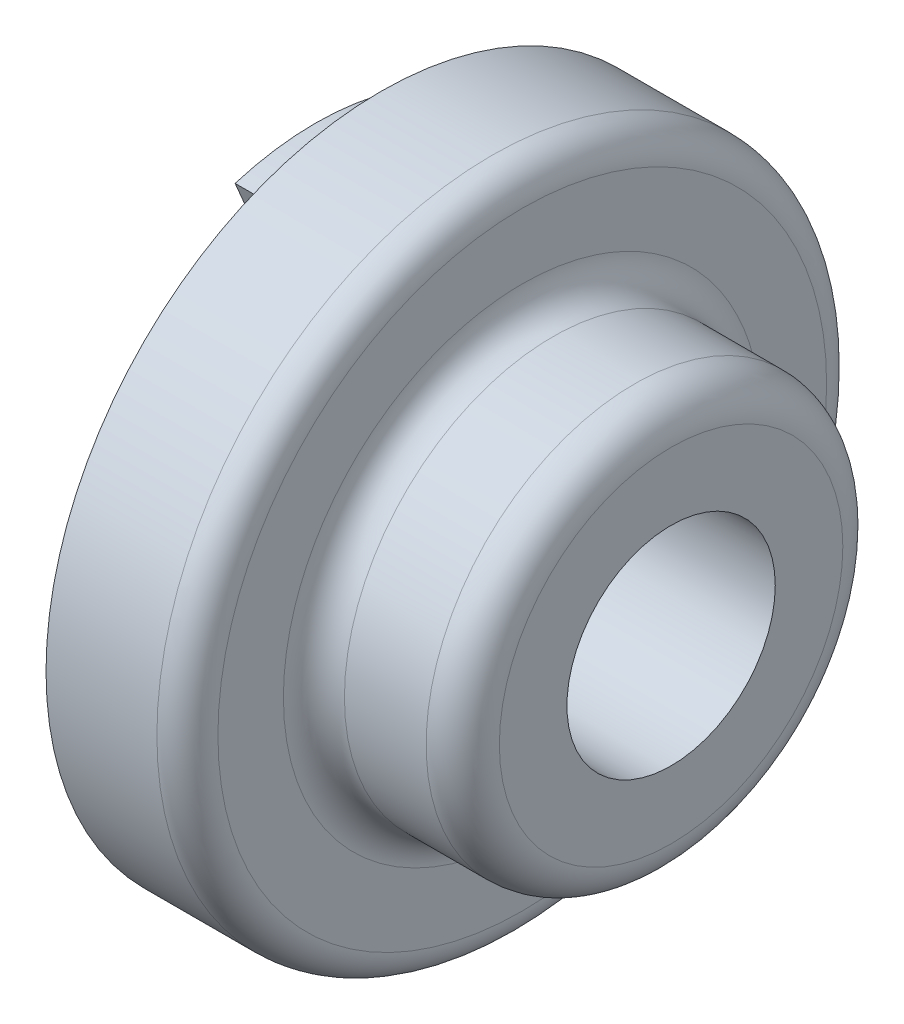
ISO-10303-21;
HEADER;
FILE_DESCRIPTION(('STEP AP214'),'2;1');
FILE_NAME('part.step','',(''),(''),'','','');
FILE_SCHEMA(('AUTOMOTIVE_DESIGN { 1 0 10303 214 1 1 1 1 }'));
ENDSEC;
DATA;
#1=APPLICATION_CONTEXT('core data for automotive mechanical design processes');
#2=APPLICATION_PROTOCOL_DEFINITION('international standard','automotive_design',2000,#1);
#3=PRODUCT_CONTEXT('',#1,'mechanical');
#4=PRODUCT('Part','Part','',(#3));
#5=PRODUCT_RELATED_PRODUCT_CATEGORY('part','',(#4));
#6=PRODUCT_DEFINITION_FORMATION('','',#4);
#7=PRODUCT_DEFINITION_CONTEXT('part definition',#1,'design');
#8=PRODUCT_DEFINITION('design','',#6,#7);
#9=PRODUCT_DEFINITION_SHAPE('','',#8);
#10=(LENGTH_UNIT() NAMED_UNIT(*) SI_UNIT(.MILLI.,.METRE.));
#11=(NAMED_UNIT(*) PLANE_ANGLE_UNIT() SI_UNIT($,.RADIAN.));
#12=(NAMED_UNIT(*) SI_UNIT($,.STERADIAN.) SOLID_ANGLE_UNIT());
#13=UNCERTAINTY_MEASURE_WITH_UNIT(LENGTH_MEASURE(1.E-05),#10,'distance_accuracy_value','');
#14=(GEOMETRIC_REPRESENTATION_CONTEXT(3) GLOBAL_UNCERTAINTY_ASSIGNED_CONTEXT((#13)) GLOBAL_UNIT_ASSIGNED_CONTEXT((#10,
#11,#12)) REPRESENTATION_CONTEXT('',''));
#15=CARTESIAN_POINT('',(0.,0.,0.));
#16=DIRECTION('',(0.,0.,1.));
#17=DIRECTION('',(1.,0.,0.));
#18=AXIS2_PLACEMENT_3D('',#15,#16,#17);
#19=CARTESIAN_POINT('',(20.5,5.77,0.));
#20=DIRECTION('',(1.,0.,0.));
#21=DIRECTION('',(0.,0.,-1.));
#22=AXIS2_PLACEMENT_3D('',#19,#20,#21);
#23=PLANE('',#22);
#24=CARTESIAN_POINT('',(20.5,0.,0.));
#25=DIRECTION('',(1.,0.,0.));
#26=DIRECTION('',(0.,0.,-1.));
#27=AXIS2_PLACEMENT_3D('',#24,#25,#26);
#28=CIRCLE('',#27,7.);
#29=CARTESIAN_POINT('',(20.5,0.,-7.));
#30=VERTEX_POINT('',#29);
#31=EDGE_CURVE('E224',#30,#30,#28,.F.);
#32=ORIENTED_EDGE('',*,*,#31,.T.);
#33=EDGE_LOOP('',(#32));
#34=FACE_BOUND('',#33,.T.);
#35=CARTESIAN_POINT('',(20.5,0.,0.));
#36=DIRECTION('',(-1.,0.,0.));
#37=DIRECTION('',(0.,0.,-1.));
#38=AXIS2_PLACEMENT_3D('',#35,#36,#37);
#39=CIRCLE('',#38,11.54);
#40=CARTESIAN_POINT('',(20.5,0.,-11.54));
#41=VERTEX_POINT('',#40);
#42=CARTESIAN_POINT('',(20.5,0.,11.54));
#43=VERTEX_POINT('',#42);
#44=EDGE_CURVE('E589',#41,#43,#39,.T.);
#45=ORIENTED_EDGE('',*,*,#44,.F.);
#46=CARTESIAN_POINT('',(20.5,0.,0.));
#47=DIRECTION('',(-1.,0.,0.));
#48=DIRECTION('',(0.,1.,0.));
#49=AXIS2_PLACEMENT_3D('',#46,#47,#48);
#50=CIRCLE('',#49,11.54);
#51=CARTESIAN_POINT('',(20.5,11.54,0.));
#52=VERTEX_POINT('',#51);
#53=EDGE_CURVE('E187',#52,#41,#50,.T.);
#54=ORIENTED_EDGE('',*,*,#53,.F.);
#55=CARTESIAN_POINT('',(20.5,0.,0.));
#56=DIRECTION('',(-1.,0.,0.));
#57=DIRECTION('',(0.,0.,1.));
#58=AXIS2_PLACEMENT_3D('',#55,#56,#57);
#59=CIRCLE('',#58,11.54);
#60=EDGE_CURVE('E591',#43,#52,#59,.T.);
#61=ORIENTED_EDGE('',*,*,#60,.F.);
#62=EDGE_LOOP('',(#45,#54,#61));
#63=FACE_BOUND('',#62,.T.);
#64=ADVANCED_FACE('F16',(#34,#63),#23,.T.);
#65=CARTESIAN_POINT('',(18.04,0.,0.));
#66=DIRECTION('',(1.,0.,0.));
#67=DIRECTION('',(0.,0.,-1.));
#68=AXIS2_PLACEMENT_3D('',#65,#66,#67);
#69=TOROIDAL_SURFACE('',#68,11.54,2.46);
#70=CARTESIAN_POINT('',(18.04,0.,0.));
#71=DIRECTION('',(1.,0.,0.));
#72=DIRECTION('',(0.,0.,-1.));
#73=AXIS2_PLACEMENT_3D('',#70,#71,#72);
#74=CIRCLE('',#73,14.);
#75=CARTESIAN_POINT('',(18.04,0.,-14.));
#76=VERTEX_POINT('',#75);
#77=EDGE_CURVE('E227',#76,#76,#74,.F.);
#78=ORIENTED_EDGE('',*,*,#77,.F.);
#79=EDGE_LOOP('',(#78));
#80=FACE_BOUND('',#79,.T.);
#81=ORIENTED_EDGE('',*,*,#60,.T.);
#82=ORIENTED_EDGE('',*,*,#53,.T.);
#83=ORIENTED_EDGE('',*,*,#44,.T.);
#84=EDGE_LOOP('',(#81,#82,#83));
#85=FACE_BOUND('',#84,.T.);
#86=ADVANCED_FACE('F392',(#80,#85),#69,.T.);
#87=CARTESIAN_POINT('',(0.,0.,0.));
#88=DIRECTION('',(-1.,0.,0.));
#89=DIRECTION('',(0.,0.,1.));
#90=AXIS2_PLACEMENT_3D('',#87,#88,#89);
#91=PLANE('',#90);
#92=CARTESIAN_POINT('',(0.,0.,0.));
#93=DIRECTION('',(1.,0.,0.));
#94=DIRECTION('',(0.,0.,-1.));
#95=AXIS2_PLACEMENT_3D('',#92,#93,#94);
#96=CIRCLE('',#95,7.);
#97=CARTESIAN_POINT('',(0.,6.94652777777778,-0.86356924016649));
#98=VERTEX_POINT('',#97);
#99=CARTESIAN_POINT('',(0.,6.94652777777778,0.863569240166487));
#100=VERTEX_POINT('',#99);
#101=EDGE_CURVE('E186',#98,#100,#96,.T.);
#102=ORIENTED_EDGE('',*,*,#101,.T.);
#103=CARTESIAN_POINT('',(0.,7.2,0.));
#104=DIRECTION('',(1.,0.,0.));
#105=DIRECTION('',(0.,0.,-1.));
#106=AXIS2_PLACEMENT_3D('',#103,#104,#105);
#107=CIRCLE('',#106,0.9);
#108=EDGE_CURVE('E220',#98,#100,#107,.F.);
#109=ORIENTED_EDGE('',*,*,#108,.F.);
#110=EDGE_LOOP('',(#102,#109));
#111=FACE_BOUND('',#110,.T.);
#112=ADVANCED_FACE('F403',(#111),#91,.F.);
#113=CARTESIAN_POINT('',(0.,0.,0.));
#114=DIRECTION('',(-1.,0.,0.));
#115=DIRECTION('',(0.,0.,1.));
#116=AXIS2_PLACEMENT_3D('',#113,#114,#115);
#117=PLANE('',#116);
#118=CARTESIAN_POINT('',(0.,0.,0.));
#119=DIRECTION('',(1.,0.,0.));
#120=DIRECTION('',(0.,0.,-1.));
#121=AXIS2_PLACEMENT_3D('',#118,#119,#120);
#122=CIRCLE('',#121,7.);
#123=CARTESIAN_POINT('',(0.,-6.94652777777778,0.863569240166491));
#124=VERTEX_POINT('',#123);
#125=CARTESIAN_POINT('',(0.,-6.94652777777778,-0.863569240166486));
#126=VERTEX_POINT('',#125);
#127=EDGE_CURVE('E179',#124,#126,#122,.T.);
#128=ORIENTED_EDGE('',*,*,#127,.T.);
#129=CARTESIAN_POINT('',(0.,-7.2,0.));
#130=DIRECTION('',(1.,0.,0.));
#131=DIRECTION('',(0.,0.,-1.));
#132=AXIS2_PLACEMENT_3D('',#129,#130,#131);
#133=CIRCLE('',#132,0.9);
#134=EDGE_CURVE('E184',#124,#126,#133,.F.);
#135=ORIENTED_EDGE('',*,*,#134,.F.);
#136=EDGE_LOOP('',(#128,#135));
#137=FACE_BOUND('',#136,.T.);
#138=ADVANCED_FACE('F182',(#137),#117,.F.);
#139=CARTESIAN_POINT('',(12.3,0.,0.));
#140=DIRECTION('',(1.,0.,0.));
#141=DIRECTION('',(0.,0.,-1.));
#142=AXIS2_PLACEMENT_3D('',#139,#140,#141);
#143=CYLINDRICAL_SURFACE('',#142,7.);
#144=ORIENTED_EDGE('',*,*,#31,.F.);
#145=EDGE_LOOP('',(#144));
#146=FACE_BOUND('',#145,.T.);
#147=CARTESIAN_POINT('',(6.5,0.,0.));
#148=DIRECTION('',(1.,0.,0.));
#149=DIRECTION('',(0.,0.,-1.));
#150=AXIS2_PLACEMENT_3D('',#147,#148,#149);
#151=CIRCLE('',#150,7.);
#152=CARTESIAN_POINT('',(6.5,6.94652777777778,0.863569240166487));
#153=VERTEX_POINT('',#152);
#154=CARTESIAN_POINT('',(6.5,-6.94652777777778,0.86356924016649));
#155=VERTEX_POINT('',#154);
#156=EDGE_CURVE('E217',#153,#155,#151,.T.);
#157=ORIENTED_EDGE('',*,*,#156,.F.);
#158=DIRECTION('',(1.,0.,0.));
#159=VECTOR('',#158,1.);
#160=CARTESIAN_POINT('',(-3.4,6.94652777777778,0.863569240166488));
#161=LINE('',#160,#159);
#162=EDGE_CURVE('E375',#100,#153,#161,.T.);
#163=ORIENTED_EDGE('',*,*,#162,.F.);
#164=ORIENTED_EDGE('',*,*,#101,.F.);
#165=DIRECTION('',(1.,0.,0.));
#166=VECTOR('',#165,1.);
#167=CARTESIAN_POINT('',(-3.4,6.94652777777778,-0.863569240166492));
#168=LINE('',#167,#166);
#169=CARTESIAN_POINT('',(6.5,6.94652777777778,-0.863569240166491));
#170=VERTEX_POINT('',#169);
#171=EDGE_CURVE('E223',#170,#98,#168,.F.);
#172=ORIENTED_EDGE('',*,*,#171,.F.);
#173=CARTESIAN_POINT('',(6.5,0.,0.));
#174=DIRECTION('',(1.,0.,0.));
#175=DIRECTION('',(0.,0.,-1.));
#176=AXIS2_PLACEMENT_3D('',#173,#174,#175);
#177=CIRCLE('',#176,7.);
#178=CARTESIAN_POINT('',(6.5,-6.94652777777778,-0.863569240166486));
#179=VERTEX_POINT('',#178);
#180=EDGE_CURVE('E193',#179,#170,#177,.T.);
#181=ORIENTED_EDGE('',*,*,#180,.F.);
#182=DIRECTION('',(1.,0.,0.));
#183=VECTOR('',#182,1.);
#184=CARTESIAN_POINT('',(-3.4,-6.94652777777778,-0.863569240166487));
#185=LINE('',#184,#183);
#186=EDGE_CURVE('E190',#126,#179,#185,.T.);
#187=ORIENTED_EDGE('',*,*,#186,.F.);
#188=ORIENTED_EDGE('',*,*,#127,.F.);
#189=DIRECTION('',(1.,0.,0.));
#190=VECTOR('',#189,1.);
#191=CARTESIAN_POINT('',(-3.4,-6.94652777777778,0.863569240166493));
#192=LINE('',#191,#190);
#193=EDGE_CURVE('E201',#155,#124,#192,.F.);
#194=ORIENTED_EDGE('',*,*,#193,.F.);
#195=EDGE_LOOP('',(#157,#163,#164,#172,#181,#187,#188,#194));
#196=FACE_BOUND('',#195,.T.);
#197=ADVANCED_FACE('F191',(#146,#196),#143,.F.);
#198=CARTESIAN_POINT('',(15.295,0.,0.));
#199=DIRECTION('',(1.,0.,0.));
#200=DIRECTION('',(0.,0.,-1.));
#201=AXIS2_PLACEMENT_3D('',#198,#199,#200);
#202=CYLINDRICAL_SURFACE('',#201,14.);
#203=CARTESIAN_POINT('',(12.55,0.,0.));
#204=DIRECTION('',(-1.,0.,0.));
#205=DIRECTION('',(0.,0.,1.));
#206=AXIS2_PLACEMENT_3D('',#203,#204,#205);
#207=CIRCLE('',#206,14.);
#208=CARTESIAN_POINT('',(12.55,0.,14.));
#209=VERTEX_POINT('',#208);
#210=EDGE_CURVE('E353',#209,#209,#207,.T.);
#211=ORIENTED_EDGE('',*,*,#210,.F.);
#212=EDGE_LOOP('',(#211));
#213=FACE_BOUND('',#212,.T.);
#214=ORIENTED_EDGE('',*,*,#77,.T.);
#215=EDGE_LOOP('',(#214));
#216=FACE_BOUND('',#215,.T.);
#217=ADVANCED_FACE('F622',(#213,#216),#202,.T.);
#218=CARTESIAN_POINT('',(-3.4,7.2,0.));
#219=DIRECTION('',(1.,0.,0.));
#220=DIRECTION('',(0.,0.,-1.));
#221=AXIS2_PLACEMENT_3D('',#218,#219,#220);
#222=CYLINDRICAL_SURFACE('',#221,0.9);
#223=ORIENTED_EDGE('',*,*,#171,.T.);
#224=ORIENTED_EDGE('',*,*,#108,.T.);
#225=ORIENTED_EDGE('',*,*,#162,.T.);
#226=CARTESIAN_POINT('',(6.5,7.2,0.));
#227=DIRECTION('',(1.,0.,0.));
#228=DIRECTION('',(0.,0.,-1.));
#229=AXIS2_PLACEMENT_3D('',#226,#227,#228);
#230=CIRCLE('',#229,0.9);
#231=CARTESIAN_POINT('',(6.5,7.04371664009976,0.886326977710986));
#232=VERTEX_POINT('',#231);
#233=EDGE_CURVE('E203',#232,#153,#230,.T.);
#234=ORIENTED_EDGE('',*,*,#233,.F.);
#235=DIRECTION('',(1.,0.,0.));
#236=VECTOR('',#235,1.);
#237=CARTESIAN_POINT('',(-3.4,7.04371664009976,0.886326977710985));
#238=LINE('',#237,#236);
#239=CARTESIAN_POINT('',(-3.4,7.04371664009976,0.886326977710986));
#240=VERTEX_POINT('',#239);
#241=EDGE_CURVE('E347',#240,#232,#238,.T.);
#242=ORIENTED_EDGE('',*,*,#241,.F.);
#243=CARTESIAN_POINT('',(-3.4,7.2,0.));
#244=DIRECTION('',(1.,0.,0.));
#245=DIRECTION('',(0.,0.,-1.));
#246=AXIS2_PLACEMENT_3D('',#243,#244,#245);
#247=CIRCLE('',#246,0.9);
#248=CARTESIAN_POINT('',(-3.4,7.04371664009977,-0.886326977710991));
#249=VERTEX_POINT('',#248);
#250=EDGE_CURVE('E370',#240,#249,#247,.T.);
#251=ORIENTED_EDGE('',*,*,#250,.T.);
#252=DIRECTION('',(1.,0.,0.));
#253=VECTOR('',#252,1.);
#254=CARTESIAN_POINT('',(-3.4,7.04371664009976,-0.886326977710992));
#255=LINE('',#254,#253);
#256=CARTESIAN_POINT('',(6.5,7.04371664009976,-0.886326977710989));
#257=VERTEX_POINT('',#256);
#258=EDGE_CURVE('E352',#257,#249,#255,.F.);
#259=ORIENTED_EDGE('',*,*,#258,.F.);
#260=CARTESIAN_POINT('',(6.5,7.2,0.));
#261=DIRECTION('',(1.,0.,0.));
#262=DIRECTION('',(0.,0.,-1.));
#263=AXIS2_PLACEMENT_3D('',#260,#261,#262);
#264=CIRCLE('',#263,0.9);
#265=EDGE_CURVE('E671',#170,#257,#264,.T.);
#266=ORIENTED_EDGE('',*,*,#265,.F.);
#267=EDGE_LOOP('',(#223,#224,#225,#234,#242,#251,#259,#266));
#268=FACE_BOUND('',#267,.T.);
#269=ADVANCED_FACE('F626',(#268),#222,.T.);
#270=CARTESIAN_POINT('',(6.5,9.305,0.));
#271=DIRECTION('',(-1.,0.,0.));
#272=DIRECTION('',(0.,0.,1.));
#273=AXIS2_PLACEMENT_3D('',#270,#271,#272);
#274=PLANE('',#273);
#275=DIRECTION('',(0.,-0.920240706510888,-0.391352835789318));
#276=VECTOR('',#275,1.);
#277=CARTESIAN_POINT('',(6.5,7.04371664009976,0.886326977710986));
#278=LINE('',#277,#276);
#279=CARTESIAN_POINT('',(6.5,17.643822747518,5.39425795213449));
#280=VERTEX_POINT('',#279);
#281=EDGE_CURVE('E348',#232,#280,#278,.F.);
#282=ORIENTED_EDGE('',*,*,#281,.F.);
#283=ORIENTED_EDGE('',*,*,#233,.T.);
#284=ORIENTED_EDGE('',*,*,#156,.T.);
#285=CARTESIAN_POINT('',(6.5,-7.2,0.));
#286=DIRECTION('',(1.,0.,0.));
#287=DIRECTION('',(0.,0.,-1.));
#288=AXIS2_PLACEMENT_3D('',#285,#286,#287);
#289=CIRCLE('',#288,0.9);
#290=CARTESIAN_POINT('',(6.5,-7.04371664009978,0.886326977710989));
#291=VERTEX_POINT('',#290);
#292=EDGE_CURVE('E196',#291,#155,#289,.F.);
#293=ORIENTED_EDGE('',*,*,#292,.F.);
#294=DIRECTION('',(0.,-0.920240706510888,0.391352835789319));
#295=VECTOR('',#294,1.);
#296=CARTESIAN_POINT('',(6.5,-17.643822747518,5.39425795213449));
#297=LINE('',#296,#295);
#298=CARTESIAN_POINT('',(6.5,-17.643822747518,5.3942579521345));
#299=VERTEX_POINT('',#298);
#300=EDGE_CURVE('E329',#299,#291,#297,.F.);
#301=ORIENTED_EDGE('',*,*,#300,.F.);
#302=CARTESIAN_POINT('',(6.5,0.,0.));
#303=DIRECTION('',(-1.,0.,0.));
#304=DIRECTION('',(0.,0.,1.));
#305=AXIS2_PLACEMENT_3D('',#302,#303,#304);
#306=CIRCLE('',#305,18.45);
#307=CARTESIAN_POINT('',(6.5,-17.7009894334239,5.20360193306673));
#308=VERTEX_POINT('',#307);
#309=EDGE_CURVE('E213',#299,#308,#306,.F.);
#310=ORIENTED_EDGE('',*,*,#309,.T.);
#311=DIRECTION('',(0.,-0.926837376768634,0.375463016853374));
#312=VECTOR('',#311,1.);
#313=CARTESIAN_POINT('',(6.5,-17.7009894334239,5.20360193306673));
#314=LINE('',#313,#312);
#315=CARTESIAN_POINT('',(6.5,-17.8500064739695,5.26396892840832));
#316=VERTEX_POINT('',#315);
#317=EDGE_CURVE('E216',#308,#316,#314,.T.);
#318=ORIENTED_EDGE('',*,*,#317,.T.);
#319=CARTESIAN_POINT('',(6.5,0.,0.));
#320=DIRECTION('',(1.,0.,0.));
#321=DIRECTION('',(0.,0.,-1.));
#322=AXIS2_PLACEMENT_3D('',#319,#320,#321);
#323=CIRCLE('',#322,18.61);
#324=CARTESIAN_POINT('',(6.5,17.8500064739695,5.26396892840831));
#325=VERTEX_POINT('',#324);
#326=EDGE_CURVE('E333',#325,#316,#323,.T.);
#327=ORIENTED_EDGE('',*,*,#326,.F.);
#328=DIRECTION('',(0.,-0.926837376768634,-0.375463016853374));
#329=VECTOR('',#328,1.);
#330=CARTESIAN_POINT('',(6.5,17.8500064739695,5.26396892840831));
#331=LINE('',#330,#329);
#332=CARTESIAN_POINT('',(6.5,17.7009894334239,5.20360193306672));
#333=VERTEX_POINT('',#332);
#334=EDGE_CURVE('E212',#325,#333,#331,.T.);
#335=ORIENTED_EDGE('',*,*,#334,.T.);
#336=CARTESIAN_POINT('',(6.5,0.,0.));
#337=DIRECTION('',(-1.,0.,0.));
#338=DIRECTION('',(0.,0.,1.));
#339=AXIS2_PLACEMENT_3D('',#336,#337,#338);
#340=CIRCLE('',#339,18.45);
#341=EDGE_CURVE('E210',#333,#280,#340,.F.);
#342=ORIENTED_EDGE('',*,*,#341,.T.);
#343=EDGE_LOOP('',(#282,#283,#284,#293,#301,#310,#318,#327,#335,#342));
#344=FACE_BOUND('',#343,.T.);
#345=ADVANCED_FACE('F633',(#344),#274,.T.);
#346=CARTESIAN_POINT('',(-3.4,-7.2,0.));
#347=DIRECTION('',(1.,0.,0.));
#348=DIRECTION('',(0.,0.,-1.));
#349=AXIS2_PLACEMENT_3D('',#346,#347,#348);
#350=CYLINDRICAL_SURFACE('',#349,0.9);
#351=DIRECTION('',(1.,0.,0.));
#352=VECTOR('',#351,1.);
#353=CARTESIAN_POINT('',(-3.4,-7.04371664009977,0.886326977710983));
#354=LINE('',#353,#352);
#355=CARTESIAN_POINT('',(-3.4,-7.04371664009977,0.886326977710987));
#356=VERTEX_POINT('',#355);
#357=EDGE_CURVE('E332',#291,#356,#354,.F.);
#358=ORIENTED_EDGE('',*,*,#357,.F.);
#359=ORIENTED_EDGE('',*,*,#292,.T.);
#360=ORIENTED_EDGE('',*,*,#193,.T.);
#361=ORIENTED_EDGE('',*,*,#134,.T.);
#362=ORIENTED_EDGE('',*,*,#186,.T.);
#363=CARTESIAN_POINT('',(6.5,-7.2,0.));
#364=DIRECTION('',(1.,0.,0.));
#365=DIRECTION('',(0.,0.,-1.));
#366=AXIS2_PLACEMENT_3D('',#363,#364,#365);
#367=CIRCLE('',#366,0.9);
#368=CARTESIAN_POINT('',(6.5,-7.04371664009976,-0.886326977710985));
#369=VERTEX_POINT('',#368);
#370=EDGE_CURVE('E372',#369,#179,#367,.T.);
#371=ORIENTED_EDGE('',*,*,#370,.F.);
#372=DIRECTION('',(1.,0.,0.));
#373=VECTOR('',#372,1.);
#374=CARTESIAN_POINT('',(-3.4,-7.04371664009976,-0.886326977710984));
#375=LINE('',#374,#373);
#376=CARTESIAN_POINT('',(-3.4,-7.04371664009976,-0.886326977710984));
#377=VERTEX_POINT('',#376);
#378=EDGE_CURVE('E327',#377,#369,#375,.T.);
#379=ORIENTED_EDGE('',*,*,#378,.F.);
#380=CARTESIAN_POINT('',(-3.4,-7.2,0.));
#381=DIRECTION('',(1.,0.,0.));
#382=DIRECTION('',(0.,0.,-1.));
#383=AXIS2_PLACEMENT_3D('',#380,#381,#382);
#384=CIRCLE('',#383,0.9);
#385=EDGE_CURVE('E362',#377,#356,#384,.T.);
#386=ORIENTED_EDGE('',*,*,#385,.T.);
#387=EDGE_LOOP('',(#358,#359,#360,#361,#362,#371,#379,#386));
#388=FACE_BOUND('',#387,.T.);
#389=ADVANCED_FACE('F199',(#388),#350,.T.);
#390=CARTESIAN_POINT('',(6.5,9.305,0.));
#391=DIRECTION('',(-1.,0.,0.));
#392=DIRECTION('',(0.,0.,1.));
#393=AXIS2_PLACEMENT_3D('',#390,#391,#392);
#394=PLANE('',#393);
#395=DIRECTION('',(0.,0.920240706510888,0.391352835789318));
#396=VECTOR('',#395,1.);
#397=CARTESIAN_POINT('',(6.5,-7.04371664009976,-0.886326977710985));
#398=LINE('',#397,#396);
#399=CARTESIAN_POINT('',(6.5,-17.643822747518,-5.39425795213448));
#400=VERTEX_POINT('',#399);
#401=EDGE_CURVE('E328',#369,#400,#398,.F.);
#402=ORIENTED_EDGE('',*,*,#401,.F.);
#403=ORIENTED_EDGE('',*,*,#370,.T.);
#404=ORIENTED_EDGE('',*,*,#180,.T.);
#405=ORIENTED_EDGE('',*,*,#265,.T.);
#406=DIRECTION('',(0.,0.920240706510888,-0.391352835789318));
#407=VECTOR('',#406,1.);
#408=CARTESIAN_POINT('',(6.5,17.643822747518,-5.39425795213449));
#409=LINE('',#408,#407);
#410=CARTESIAN_POINT('',(6.5,17.643822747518,-5.39425795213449));
#411=VERTEX_POINT('',#410);
#412=EDGE_CURVE('E349',#411,#257,#409,.F.);
#413=ORIENTED_EDGE('',*,*,#412,.F.);
#414=CARTESIAN_POINT('',(6.5,0.,0.));
#415=DIRECTION('',(-1.,0.,0.));
#416=DIRECTION('',(0.,0.,1.));
#417=AXIS2_PLACEMENT_3D('',#414,#415,#416);
#418=CIRCLE('',#417,18.45);
#419=CARTESIAN_POINT('',(6.5,17.7009894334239,-5.20360193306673));
#420=VERTEX_POINT('',#419);
#421=EDGE_CURVE('E425',#411,#420,#418,.F.);
#422=ORIENTED_EDGE('',*,*,#421,.T.);
#423=DIRECTION('',(0.,0.926837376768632,-0.375463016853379));
#424=VECTOR('',#423,1.);
#425=CARTESIAN_POINT('',(6.5,17.7009894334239,-5.20360193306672));
#426=LINE('',#425,#424);
#427=CARTESIAN_POINT('',(6.5,17.8500064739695,-5.26396892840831));
#428=VERTEX_POINT('',#427);
#429=EDGE_CURVE('E422',#420,#428,#426,.T.);
#430=ORIENTED_EDGE('',*,*,#429,.T.);
#431=CARTESIAN_POINT('',(6.5,0.,0.));
#432=DIRECTION('',(1.,0.,0.));
#433=DIRECTION('',(0.,0.,-1.));
#434=AXIS2_PLACEMENT_3D('',#431,#432,#433);
#435=CIRCLE('',#434,18.61);
#436=CARTESIAN_POINT('',(6.5,-17.8500064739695,-5.26396892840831));
#437=VERTEX_POINT('',#436);
#438=EDGE_CURVE('E356',#437,#428,#435,.T.);
#439=ORIENTED_EDGE('',*,*,#438,.F.);
#440=DIRECTION('',(0.,0.926837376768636,0.37546301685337));
#441=VECTOR('',#440,1.);
#442=CARTESIAN_POINT('',(6.5,-17.8500064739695,-5.26396892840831));
#443=LINE('',#442,#441);
#444=CARTESIAN_POINT('',(6.5,-17.7009894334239,-5.20360193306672));
#445=VERTEX_POINT('',#444);
#446=EDGE_CURVE('E418',#437,#445,#443,.T.);
#447=ORIENTED_EDGE('',*,*,#446,.T.);
#448=CARTESIAN_POINT('',(6.5,0.,0.));
#449=DIRECTION('',(-1.,0.,0.));
#450=DIRECTION('',(0.,0.,1.));
#451=AXIS2_PLACEMENT_3D('',#448,#449,#450);
#452=CIRCLE('',#451,18.45);
#453=EDGE_CURVE('E421',#445,#400,#452,.F.);
#454=ORIENTED_EDGE('',*,*,#453,.T.);
#455=EDGE_LOOP('',(#402,#403,#404,#405,#413,#422,#430,#439,#447,#454));
#456=FACE_BOUND('',#455,.T.);
#457=ADVANCED_FACE('F525',(#456),#394,.T.);
#458=CARTESIAN_POINT('',(12.55,0.,0.));
#459=DIRECTION('',(1.,0.,0.));
#460=DIRECTION('',(0.,0.,-1.));
#461=AXIS2_PLACEMENT_3D('',#458,#459,#460);
#462=TOROIDAL_SURFACE('',#461,16.05,2.05);
#463=CARTESIAN_POINT('',(10.5,0.,16.05));
#464=CARTESIAN_POINT('',(10.5,1.47254158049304,16.049951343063));
#465=CARTESIAN_POINT('',(10.5,2.92050699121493,15.782051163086));
#466=CARTESIAN_POINT('',(10.5,4.45549418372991,15.4980503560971));
#467=CARTESIAN_POINT('',(10.5,5.90792008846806,14.923102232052));
#468=CARTESIAN_POINT('',(10.5,7.42034299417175,14.3244040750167));
#469=CARTESIAN_POINT('',(10.5,8.78271654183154,13.4337779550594));
#470=CARTESIAN_POINT('',(10.5,10.1734116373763,12.5246371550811));
#471=CARTESIAN_POINT('',(10.5,11.3490638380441,11.3490638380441));
#472=CARTESIAN_POINT('',(10.5,12.5239585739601,10.1742479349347));
#473=CARTESIAN_POINT('',(10.5,13.4337779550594,8.78271654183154));
#474=CARTESIAN_POINT('',(10.5,14.323920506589,7.42128005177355));
#475=CARTESIAN_POINT('',(10.5,14.923102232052,5.90792008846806));
#476=CARTESIAN_POINT('',(10.5,15.4977590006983,4.45650308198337));
#477=CARTESIAN_POINT('',(10.5,15.782051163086,2.92050699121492));
#478=CARTESIAN_POINT('',(10.5,16.0499513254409,1.47307488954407));
#479=CARTESIAN_POINT('',(10.5,16.05,0.));
#480=B_SPLINE_CURVE_WITH_KNOTS('',2,(#463,#464,#465,#466,#467,#468,#469,#470,#471,#472,#473,
#474,#475,#476,#477,#478,#479),.UNSPECIFIED.,.F.,.F.,(3,2,2,2,2,2,2,2,3),(0.,0.125,0.25,0.375,
0.5,0.625,0.75,0.875,1.),.UNSPECIFIED.);
#481=CARTESIAN_POINT('',(10.5,0.,16.05));
#482=VERTEX_POINT('',#481);
#483=CARTESIAN_POINT('',(10.5,16.05,0.));
#484=VERTEX_POINT('',#483);
#485=EDGE_CURVE('E463',#482,#484,#480,.T.);
#486=ORIENTED_EDGE('',*,*,#485,.F.);
#487=CARTESIAN_POINT('',(10.5,0.,0.));
#488=DIRECTION('',(1.,0.,0.));
#489=DIRECTION('',(0.,0.,-1.));
#490=AXIS2_PLACEMENT_3D('',#487,#488,#489);
#491=CIRCLE('',#490,16.05);
#492=CARTESIAN_POINT('',(10.5,0.,-16.05));
#493=VERTEX_POINT('',#492);
#494=EDGE_CURVE('E314',#493,#482,#491,.F.);
#495=ORIENTED_EDGE('',*,*,#494,.F.);
#496=CARTESIAN_POINT('',(10.5,16.05,0.));
#497=CARTESIAN_POINT('',(10.5,16.0499513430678,-1.47254158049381));
#498=CARTESIAN_POINT('',(10.5,15.782051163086,-2.92050699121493));
#499=CARTESIAN_POINT('',(10.5,15.4980503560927,-4.45549418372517));
#500=CARTESIAN_POINT('',(10.5,14.923102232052,-5.90792008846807));
#501=CARTESIAN_POINT('',(10.5,14.3244040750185,-7.42034299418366));
#502=CARTESIAN_POINT('',(10.5,13.4337779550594,-8.78271654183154));
#503=CARTESIAN_POINT('',(10.5,12.5246371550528,-10.1734116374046));
#504=CARTESIAN_POINT('',(10.5,11.3490638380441,-11.3490638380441));
#505=CARTESIAN_POINT('',(10.5,10.1742479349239,-12.5239585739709));
#506=CARTESIAN_POINT('',(10.5,8.78271654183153,-13.4337779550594));
#507=CARTESIAN_POINT('',(10.5,7.4212800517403,-14.3239205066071));
#508=CARTESIAN_POINT('',(10.5,5.90792008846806,-14.923102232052));
#509=CARTESIAN_POINT('',(10.5,4.45650308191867,-15.4977590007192));
#510=CARTESIAN_POINT('',(10.5,2.92050699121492,-15.782051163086));
#511=CARTESIAN_POINT('',(10.5,1.47307488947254,-16.0499513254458));
#512=CARTESIAN_POINT('',(10.5,0.,-16.05));
#513=B_SPLINE_CURVE_WITH_KNOTS('',2,(#496,#497,#498,#499,#500,#501,#502,#503,#504,#505,#506,
#507,#508,#509,#510,#511,#512),.UNSPECIFIED.,.F.,.F.,(3,2,2,2,2,2,2,2,3),(0.,0.125,0.25,0.375,
0.5,0.625,0.75,0.875,1.),.UNSPECIFIED.);
#514=EDGE_CURVE('E466',#484,#493,#513,.T.);
#515=ORIENTED_EDGE('',*,*,#514,.F.);
#516=EDGE_LOOP('',(#486,#495,#515));
#517=FACE_BOUND('',#516,.T.);
#518=ORIENTED_EDGE('',*,*,#210,.T.);
#519=EDGE_LOOP('',(#518));
#520=FACE_BOUND('',#519,.T.);
#521=ADVANCED_FACE('F521',(#517,#520),#462,.F.);
#522=CARTESIAN_POINT('',(-3.4,17.643822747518,-5.39425795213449));
#523=DIRECTION('',(0.,-0.391352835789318,-0.920240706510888));
#524=DIRECTION('',(0.,0.920240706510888,-0.391352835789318));
#525=AXIS2_PLACEMENT_3D('',#522,#523,#524);
#526=PLANE('',#525);
#527=DIRECTION('',(0.,0.920240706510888,-0.391352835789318));
#528=VECTOR('',#527,1.);
#529=CARTESIAN_POINT('',(-3.4,7.04371664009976,-0.886326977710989));
#530=LINE('',#529,#528);
#531=CARTESIAN_POINT('',(-3.4,17.643822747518,-5.39425795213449));
#532=VERTEX_POINT('',#531);
#533=EDGE_CURVE('E367',#249,#532,#530,.T.);
#534=ORIENTED_EDGE('',*,*,#533,.T.);
#535=DIRECTION('',(1.,0.,0.));
#536=VECTOR('',#535,1.);
#537=CARTESIAN_POINT('',(-3.4,17.643822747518,-5.39425795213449));
#538=LINE('',#537,#536);
#539=EDGE_CURVE('E337',#411,#532,#538,.F.);
#540=ORIENTED_EDGE('',*,*,#539,.F.);
#541=ORIENTED_EDGE('',*,*,#412,.T.);
#542=ORIENTED_EDGE('',*,*,#258,.T.);
#543=EDGE_LOOP('',(#534,#540,#541,#542));
#544=FACE_BOUND('',#543,.T.);
#545=ADVANCED_FACE('F524',(#544),#526,.T.);
#546=CARTESIAN_POINT('',(-3.4,13.6838296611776,0.));
#547=DIRECTION('',(1.,0.,0.));
#548=DIRECTION('',(0.,0.,-1.));
#549=AXIS2_PLACEMENT_3D('',#546,#547,#548);
#550=PLANE('',#549);
#551=ORIENTED_EDGE('',*,*,#250,.F.);
#552=DIRECTION('',(0.,-0.920240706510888,-0.391352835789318));
#553=VECTOR('',#552,1.);
#554=CARTESIAN_POINT('',(-3.4,7.04371664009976,0.886326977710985));
#555=LINE('',#554,#553);
#556=CARTESIAN_POINT('',(-3.4,17.643822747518,5.39425795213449));
#557=VERTEX_POINT('',#556);
#558=EDGE_CURVE('E344',#557,#240,#555,.T.);
#559=ORIENTED_EDGE('',*,*,#558,.F.);
#560=CARTESIAN_POINT('',(-3.4,0.,0.));
#561=DIRECTION('',(1.,0.,0.));
#562=DIRECTION('',(0.,0.,-1.));
#563=AXIS2_PLACEMENT_3D('',#560,#561,#562);
#564=CIRCLE('',#563,18.45);
#565=EDGE_CURVE('E340',#532,#557,#564,.T.);
#566=ORIENTED_EDGE('',*,*,#565,.F.);
#567=ORIENTED_EDGE('',*,*,#533,.F.);
#568=EDGE_LOOP('',(#551,#559,#566,#567));
#569=FACE_BOUND('',#568,.T.);
#570=ADVANCED_FACE('F644',(#569),#550,.F.);
#571=CARTESIAN_POINT('',(-3.4,7.04371664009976,0.886326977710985));
#572=DIRECTION('',(0.,-0.391352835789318,0.920240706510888));
#573=DIRECTION('',(0.,-0.920240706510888,-0.391352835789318));
#574=AXIS2_PLACEMENT_3D('',#571,#572,#573);
#575=PLANE('',#574);
#576=ORIENTED_EDGE('',*,*,#558,.T.);
#577=ORIENTED_EDGE('',*,*,#241,.T.);
#578=ORIENTED_EDGE('',*,*,#281,.T.);
#579=DIRECTION('',(1.,0.,0.));
#580=VECTOR('',#579,1.);
#581=CARTESIAN_POINT('',(-3.4,17.643822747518,5.39425795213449));
#582=LINE('',#581,#580);
#583=EDGE_CURVE('E300',#557,#280,#582,.T.);
#584=ORIENTED_EDGE('',*,*,#583,.F.);
#585=EDGE_LOOP('',(#576,#577,#578,#584));
#586=FACE_BOUND('',#585,.T.);
#587=ADVANCED_FACE('F648',(#586),#575,.T.);
#588=CARTESIAN_POINT('',(4.86,0.,0.));
#589=DIRECTION('',(1.,0.,0.));
#590=DIRECTION('',(0.,0.,-1.));
#591=AXIS2_PLACEMENT_3D('',#588,#589,#590);
#592=TOROIDAL_SURFACE('',#591,18.61,1.64);
#593=CARTESIAN_POINT('',(4.86,-19.3767680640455,5.88246201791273));
#594=CARTESIAN_POINT('',(4.90600148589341,-19.3767678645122,5.88246193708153));
#595=CARTESIAN_POINT('',(4.95198088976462,-19.3749657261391,5.88173188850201));
#596=CARTESIAN_POINT('',(5.04360969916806,-19.3677768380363,5.87881966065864));
#597=CARTESIAN_POINT('',(5.08925912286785,-19.3623902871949,5.87663756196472));
#598=CARTESIAN_POINT('',(5.22513200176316,-19.3409078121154,5.86793498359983));
#599=CARTESIAN_POINT('',(5.31444374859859,-19.3194889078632,5.85925815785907));
#600=CARTESIAN_POINT('',(5.48791474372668,-19.2630636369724,5.83640020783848));
#601=CARTESIAN_POINT('',(5.5720716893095,-19.2280512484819,5.82221664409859));
#602=CARTESIAN_POINT('',(5.73286309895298,-19.1454529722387,5.78875597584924));
#603=CARTESIAN_POINT('',(5.80949865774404,-19.0978689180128,5.76947961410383));
#604=CARTESIAN_POINT('',(5.95321982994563,-18.9914020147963,5.72634973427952));
#605=CARTESIAN_POINT('',(6.02028904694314,-18.9325001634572,5.70248851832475));
#606=CARTESIAN_POINT('',(6.1428698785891,-18.8051191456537,5.65088630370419));
#607=CARTESIAN_POINT('',(6.19837917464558,-18.7366380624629,5.62314452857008));
#608=CARTESIAN_POINT('',(6.29648812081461,-18.591764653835,5.5644561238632));
#609=CARTESIAN_POINT('',(6.3390343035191,-18.5153412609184,5.53349690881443));
#610=CARTESIAN_POINT('',(6.40972490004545,-18.3569910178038,5.46934902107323));
#611=CARTESIAN_POINT('',(6.43787674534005,-18.2750670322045,5.43616150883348));
#612=CARTESIAN_POINT('',(6.47226133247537,-18.1355685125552,5.3796504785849));
#613=CARTESIAN_POINT('',(6.48265761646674,-18.0788448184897,5.35667163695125));
#614=CARTESIAN_POINT('',(6.49652621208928,-17.9647571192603,5.31045456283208));
#615=CARTESIAN_POINT('',(6.50000839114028,-17.9073941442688,5.28721674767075));
#616=CARTESIAN_POINT('',(6.5,-17.8500064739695,5.26396892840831));
#617=B_SPLINE_CURVE_WITH_KNOTS('',3,(#593,#594,#595,#596,#597,#598,#599,#600,#601,#602,#603,
#604,#605,#606,#607,#608,#609,#610,#611,#612,#613,#614,#615,#616),.UNSPECIFIED.,.F.,.F.,(4,2,2,
2,2,2,2,2,2,2,2,4),(0.,0.137919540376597,0.275831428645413,0.551170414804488,0.826631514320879,
1.10205246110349,1.37793993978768,1.65388270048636,1.9309486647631,2.20787144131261,
2.39374028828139,2.57934368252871),.UNSPECIFIED.);
#618=CARTESIAN_POINT('',(4.86,-19.3767680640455,5.88246201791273));
#619=VERTEX_POINT('',#618);
#620=EDGE_CURVE('E321',#619,#316,#617,.T.);
#621=ORIENTED_EDGE('',*,*,#620,.F.);
#622=CARTESIAN_POINT('',(4.86,0.,0.));
#623=DIRECTION('',(1.,0.,0.));
#624=DIRECTION('',(0.,0.,-1.));
#625=AXIS2_PLACEMENT_3D('',#622,#623,#624);
#626=CIRCLE('',#625,20.25);
#627=CARTESIAN_POINT('',(4.86,19.3767680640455,5.88246201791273));
#628=VERTEX_POINT('',#627);
#629=EDGE_CURVE('E292',#619,#628,#626,.F.);
#630=ORIENTED_EDGE('',*,*,#629,.T.);
#631=CARTESIAN_POINT('',(6.49999999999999,17.8500064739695,5.26396892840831));
#632=CARTESIAN_POINT('',(6.49999957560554,17.8931075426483,5.28142922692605));
#633=CARTESIAN_POINT('',(6.49803980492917,17.9361880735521,5.29888120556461));
#634=CARTESIAN_POINT('',(6.49021984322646,18.0220423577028,5.33366088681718));
#635=CARTESIAN_POINT('',(6.48435978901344,18.0648161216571,5.35098859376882));
#636=CARTESIAN_POINT('',(6.46097986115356,18.1921555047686,5.4025739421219));
#637=CARTESIAN_POINT('',(6.43766009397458,18.2758704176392,5.43648696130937));
#638=CARTESIAN_POINT('',(6.37617762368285,18.438484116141,5.50236198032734));
#639=CARTESIAN_POINT('',(6.33800686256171,18.5173802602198,5.53432291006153));
#640=CARTESIAN_POINT('',(6.24788696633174,18.6680880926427,5.59537484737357));
#641=CARTESIAN_POINT('',(6.19594088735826,18.7399013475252,5.62446648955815));
#642=CARTESIAN_POINT('',(6.07986736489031,18.8742127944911,5.6788762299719));
#643=CARTESIAN_POINT('',(6.01576990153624,18.9367332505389,5.70420334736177));
#644=CARTESIAN_POINT('',(5.87710079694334,19.0508751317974,5.75044237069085));
#645=CARTESIAN_POINT('',(5.8025271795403,19.1024944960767,5.77135344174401));
#646=CARTESIAN_POINT('',(5.64536837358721,19.1931272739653,5.8080688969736));
#647=CARTESIAN_POINT('',(5.56281674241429,19.2321907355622,5.82389355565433));
#648=CARTESIAN_POINT('',(5.39180958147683,19.2968433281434,5.85008440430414));
#649=CARTESIAN_POINT('',(5.30335790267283,19.3224411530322,5.86045411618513));
#650=CARTESIAN_POINT('',(5.15527297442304,19.3528467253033,5.8727714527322));
#651=CARTESIAN_POINT('',(5.09659488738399,19.3618119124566,5.87640326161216));
#652=CARTESIAN_POINT('',(4.97861965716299,19.3737715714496,5.88124813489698));
#653=CARTESIAN_POINT('',(4.91932351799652,19.3767745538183,5.88246464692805));
#654=CARTESIAN_POINT('',(4.86,19.3767680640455,5.88246201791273));
#655=B_SPLINE_CURVE_WITH_KNOTS('',3,(#631,#632,#633,#634,#635,#636,#637,#638,#639,#640,#641,
#642,#643,#644,#645,#646,#647,#648,#649,#650,#651,#652,#653,#654),.UNSPECIFIED.,.F.,.F.,(4,2,2,
2,2,2,2,2,2,2,2,4),(0.,0.139424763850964,0.278844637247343,0.557265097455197,0.835836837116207,
1.11434682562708,1.39217840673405,1.67006246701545,1.94682473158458,2.22340808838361,
2.4014912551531,2.57932004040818),.UNSPECIFIED.);
#656=EDGE_CURVE('E296',#325,#628,#655,.T.);
#657=ORIENTED_EDGE('',*,*,#656,.F.);
#658=ORIENTED_EDGE('',*,*,#326,.T.);
#659=EDGE_LOOP('',(#621,#630,#657,#658));
#660=FACE_BOUND('',#659,.T.);
#661=ADVANCED_FACE('F500',(#660),#592,.F.);
#662=CARTESIAN_POINT('',(-3.4,-17.643822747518,5.3942579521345));
#663=DIRECTION('',(0.,0.391352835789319,0.920240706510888));
#664=DIRECTION('',(0.,-0.920240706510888,0.391352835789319));
#665=AXIS2_PLACEMENT_3D('',#662,#663,#664);
#666=PLANE('',#665);
#667=DIRECTION('',(0.,-0.920240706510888,0.391352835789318));
#668=VECTOR('',#667,1.);
#669=CARTESIAN_POINT('',(-3.4,-7.04371664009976,0.88632697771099));
#670=LINE('',#669,#668);
#671=CARTESIAN_POINT('',(-3.4,-17.643822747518,5.3942579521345));
#672=VERTEX_POINT('',#671);
#673=EDGE_CURVE('E359',#356,#672,#670,.T.);
#674=ORIENTED_EDGE('',*,*,#673,.T.);
#675=DIRECTION('',(1.,0.,0.));
#676=VECTOR('',#675,1.);
#677=CARTESIAN_POINT('',(-3.4,-17.643822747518,5.3942579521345));
#678=LINE('',#677,#676);
#679=EDGE_CURVE('E317',#299,#672,#678,.F.);
#680=ORIENTED_EDGE('',*,*,#679,.F.);
#681=ORIENTED_EDGE('',*,*,#300,.T.);
#682=ORIENTED_EDGE('',*,*,#357,.T.);
#683=EDGE_LOOP('',(#674,#680,#681,#682));
#684=FACE_BOUND('',#683,.T.);
#685=ADVANCED_FACE('F653',(#684),#666,.T.);
#686=CARTESIAN_POINT('',(-3.4,-13.6838296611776,0.));
#687=DIRECTION('',(1.,0.,0.));
#688=DIRECTION('',(0.,0.,-1.));
#689=AXIS2_PLACEMENT_3D('',#686,#687,#688);
#690=PLANE('',#689);
#691=ORIENTED_EDGE('',*,*,#385,.F.);
#692=DIRECTION('',(0.,0.920240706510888,0.391352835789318));
#693=VECTOR('',#692,1.);
#694=CARTESIAN_POINT('',(-3.4,-7.04371664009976,-0.886326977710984));
#695=LINE('',#694,#693);
#696=CARTESIAN_POINT('',(-3.4,-17.643822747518,-5.39425795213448));
#697=VERTEX_POINT('',#696);
#698=EDGE_CURVE('E324',#697,#377,#695,.T.);
#699=ORIENTED_EDGE('',*,*,#698,.F.);
#700=CARTESIAN_POINT('',(-3.4,0.,0.));
#701=DIRECTION('',(1.,0.,0.));
#702=DIRECTION('',(0.,0.,-1.));
#703=AXIS2_PLACEMENT_3D('',#700,#701,#702);
#704=CIRCLE('',#703,18.45);
#705=EDGE_CURVE('E320',#672,#697,#704,.T.);
#706=ORIENTED_EDGE('',*,*,#705,.F.);
#707=ORIENTED_EDGE('',*,*,#673,.F.);
#708=EDGE_LOOP('',(#691,#699,#706,#707));
#709=FACE_BOUND('',#708,.T.);
#710=ADVANCED_FACE('F655',(#709),#690,.F.);
#711=CARTESIAN_POINT('',(-3.4,-7.04371664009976,-0.886326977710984));
#712=DIRECTION('',(0.,0.391352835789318,-0.920240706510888));
#713=DIRECTION('',(0.,0.920240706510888,0.391352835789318));
#714=AXIS2_PLACEMENT_3D('',#711,#712,#713);
#715=PLANE('',#714);
#716=ORIENTED_EDGE('',*,*,#698,.T.);
#717=ORIENTED_EDGE('',*,*,#378,.T.);
#718=ORIENTED_EDGE('',*,*,#401,.T.);
#719=DIRECTION('',(1.,0.,0.));
#720=VECTOR('',#719,1.);
#721=CARTESIAN_POINT('',(-3.4,-17.643822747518,-5.39425795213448));
#722=LINE('',#721,#720);
#723=EDGE_CURVE('E288',#697,#400,#722,.T.);
#724=ORIENTED_EDGE('',*,*,#723,.F.);
#725=EDGE_LOOP('',(#716,#717,#718,#724));
#726=FACE_BOUND('',#725,.T.);
#727=ADVANCED_FACE('F448',(#726),#715,.T.);
#728=CARTESIAN_POINT('',(4.86,0.,0.));
#729=DIRECTION('',(1.,0.,0.));
#730=DIRECTION('',(0.,0.,-1.));
#731=AXIS2_PLACEMENT_3D('',#728,#729,#730);
#732=TOROIDAL_SURFACE('',#731,18.61,1.64);
#733=CARTESIAN_POINT('',(6.5,-17.8500064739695,-5.26396892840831));
#734=CARTESIAN_POINT('',(6.49999957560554,-17.8931075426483,-5.28142922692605));
#735=CARTESIAN_POINT('',(6.49803980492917,-17.9361880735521,-5.29888120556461));
#736=CARTESIAN_POINT('',(6.49021984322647,-18.0220423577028,-5.33366088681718));
#737=CARTESIAN_POINT('',(6.48435978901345,-18.0648161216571,-5.35098859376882));
#738=CARTESIAN_POINT('',(6.46097986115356,-18.1921555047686,-5.4025739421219));
#739=CARTESIAN_POINT('',(6.43766009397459,-18.2758704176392,-5.43648696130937));
#740=CARTESIAN_POINT('',(6.37617762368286,-18.438484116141,-5.50236198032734));
#741=CARTESIAN_POINT('',(6.33800686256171,-18.5173802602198,-5.53432291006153));
#742=CARTESIAN_POINT('',(6.24788696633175,-18.6680880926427,-5.59537484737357));
#743=CARTESIAN_POINT('',(6.19594088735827,-18.7399013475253,-5.62446648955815));
#744=CARTESIAN_POINT('',(6.07986736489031,-18.8742127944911,-5.6788762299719));
#745=CARTESIAN_POINT('',(6.01576990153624,-18.9367332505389,-5.70420334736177));
#746=CARTESIAN_POINT('',(5.87710079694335,-19.0508751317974,-5.75044237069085));
#747=CARTESIAN_POINT('',(5.8025271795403,-19.1024944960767,-5.77135344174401));
#748=CARTESIAN_POINT('',(5.64536837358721,-19.1931272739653,-5.8080688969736));
#749=CARTESIAN_POINT('',(5.56281674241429,-19.2321907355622,-5.82389355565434));
#750=CARTESIAN_POINT('',(5.39180958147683,-19.2968433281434,-5.85008440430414));
#751=CARTESIAN_POINT('',(5.30335790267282,-19.3224411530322,-5.86045411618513));
#752=CARTESIAN_POINT('',(5.15527297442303,-19.3528467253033,-5.8727714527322));
#753=CARTESIAN_POINT('',(5.09659488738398,-19.3618119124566,-5.87640326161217));
#754=CARTESIAN_POINT('',(4.97861965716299,-19.3737715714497,-5.88124813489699));
#755=CARTESIAN_POINT('',(4.91932351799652,-19.3767745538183,-5.88246464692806));
#756=CARTESIAN_POINT('',(4.86,-19.3767680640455,-5.88246201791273));
#757=B_SPLINE_CURVE_WITH_KNOTS('',3,(#733,#734,#735,#736,#737,#738,#739,#740,#741,#742,#743,
#744,#745,#746,#747,#748,#749,#750,#751,#752,#753,#754,#755,#756),.UNSPECIFIED.,.F.,.F.,(4,2,2,
2,2,2,2,2,2,2,2,4),(0.,0.139424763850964,0.278844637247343,0.557265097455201,0.835836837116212,
1.11434682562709,1.39217840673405,1.67006246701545,1.9468247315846,2.22340808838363,
2.40149125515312,2.57932004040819),.UNSPECIFIED.);
#758=CARTESIAN_POINT('',(4.86,-19.3767680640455,-5.88246201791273));
#759=VERTEX_POINT('',#758);
#760=EDGE_CURVE('E284',#437,#759,#757,.T.);
#761=ORIENTED_EDGE('',*,*,#760,.F.);
#762=ORIENTED_EDGE('',*,*,#438,.T.);
#763=CARTESIAN_POINT('',(4.86,19.3767680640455,-5.88246201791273));
#764=CARTESIAN_POINT('',(4.90600148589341,19.3767678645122,-5.88246193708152));
#765=CARTESIAN_POINT('',(4.95198088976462,19.3749657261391,-5.88173188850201));
#766=CARTESIAN_POINT('',(5.04360969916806,19.3677768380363,-5.87881966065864));
#767=CARTESIAN_POINT('',(5.08925912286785,19.3623902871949,-5.87663756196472));
#768=CARTESIAN_POINT('',(5.22513200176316,19.3409078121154,-5.86793498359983));
#769=CARTESIAN_POINT('',(5.31444374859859,19.3194889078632,-5.85925815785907));
#770=CARTESIAN_POINT('',(5.48791474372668,19.2630636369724,-5.83640020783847));
#771=CARTESIAN_POINT('',(5.5720716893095,19.2280512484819,-5.82221664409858));
#772=CARTESIAN_POINT('',(5.73286309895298,19.1454529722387,-5.78875597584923));
#773=CARTESIAN_POINT('',(5.80949865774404,19.0978689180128,-5.76947961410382));
#774=CARTESIAN_POINT('',(5.95321982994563,18.9914020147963,-5.72634973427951));
#775=CARTESIAN_POINT('',(6.02028904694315,18.9325001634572,-5.70248851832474));
#776=CARTESIAN_POINT('',(6.1428698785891,18.8051191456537,-5.65088630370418));
#777=CARTESIAN_POINT('',(6.19837917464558,18.7366380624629,-5.62314452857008));
#778=CARTESIAN_POINT('',(6.29648812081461,18.591764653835,-5.5644561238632));
#779=CARTESIAN_POINT('',(6.3390343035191,18.5153412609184,-5.53349690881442));
#780=CARTESIAN_POINT('',(6.40972490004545,18.3569910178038,-5.46934902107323));
#781=CARTESIAN_POINT('',(6.43787674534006,18.2750670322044,-5.43616150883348));
#782=CARTESIAN_POINT('',(6.47226133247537,18.1355685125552,-5.37965047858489));
#783=CARTESIAN_POINT('',(6.48265761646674,18.0788448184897,-5.35667163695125));
#784=CARTESIAN_POINT('',(6.49652621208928,17.9647571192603,-5.31045456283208));
#785=CARTESIAN_POINT('',(6.50000839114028,17.9073941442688,-5.28721674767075));
#786=CARTESIAN_POINT('',(6.5,17.8500064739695,-5.26396892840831));
#787=B_SPLINE_CURVE_WITH_KNOTS('',3,(#763,#764,#765,#766,#767,#768,#769,#770,#771,#772,#773,
#774,#775,#776,#777,#778,#779,#780,#781,#782,#783,#784,#785,#786),.UNSPECIFIED.,.F.,.F.,(4,2,2,
2,2,2,2,2,2,2,2,4),(0.,0.137919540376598,0.275831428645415,0.551170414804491,0.826631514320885,
1.1020524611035,1.37793993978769,1.65388270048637,1.93094866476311,2.20787144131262,
2.39374028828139,2.57934368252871),.UNSPECIFIED.);
#788=CARTESIAN_POINT('',(4.86,19.3767680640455,-5.88246201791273));
#789=VERTEX_POINT('',#788);
#790=EDGE_CURVE('E341',#789,#428,#787,.T.);
#791=ORIENTED_EDGE('',*,*,#790,.F.);
#792=CARTESIAN_POINT('',(4.86,0.,0.));
#793=DIRECTION('',(1.,0.,0.));
#794=DIRECTION('',(0.,0.,-1.));
#795=AXIS2_PLACEMENT_3D('',#792,#793,#794);
#796=CIRCLE('',#795,20.25);
#797=EDGE_CURVE('E306',#789,#759,#796,.F.);
#798=ORIENTED_EDGE('',*,*,#797,.T.);
#799=EDGE_LOOP('',(#761,#762,#791,#798));
#800=FACE_BOUND('',#799,.T.);
#801=ADVANCED_FACE('F18',(#800),#732,.F.);
#802=CARTESIAN_POINT('',(10.5,18.25,0.));
#803=DIRECTION('',(1.,0.,0.));
#804=DIRECTION('',(0.,0.,-1.));
#805=AXIS2_PLACEMENT_3D('',#802,#803,#804);
#806=PLANE('',#805);
#807=ORIENTED_EDGE('',*,*,#514,.T.);
#808=ORIENTED_EDGE('',*,*,#494,.T.);
#809=ORIENTED_EDGE('',*,*,#485,.T.);
#810=EDGE_LOOP('',(#807,#808,#809));
#811=FACE_BOUND('',#810,.T.);
#812=CARTESIAN_POINT('',(10.5,0.,0.));
#813=DIRECTION('',(-1.,0.,0.));
#814=DIRECTION('',(0.,0.,-1.));
#815=AXIS2_PLACEMENT_3D('',#812,#813,#814);
#816=CIRCLE('',#815,20.45);
#817=CARTESIAN_POINT('',(10.5,0.,-20.45));
#818=VERTEX_POINT('',#817);
#819=CARTESIAN_POINT('',(10.5,0.,20.45));
#820=VERTEX_POINT('',#819);
#821=EDGE_CURVE('E302',#818,#820,#816,.T.);
#822=ORIENTED_EDGE('',*,*,#821,.F.);
#823=CARTESIAN_POINT('',(10.5,0.,0.));
#824=DIRECTION('',(-1.,0.,0.));
#825=DIRECTION('',(0.,1.,0.));
#826=AXIS2_PLACEMENT_3D('',#823,#824,#825);
#827=CIRCLE('',#826,20.45);
#828=CARTESIAN_POINT('',(10.5,20.45,0.));
#829=VERTEX_POINT('',#828);
#830=EDGE_CURVE('E577',#829,#818,#827,.T.);
#831=ORIENTED_EDGE('',*,*,#830,.F.);
#832=CARTESIAN_POINT('',(10.5,0.,0.));
#833=DIRECTION('',(-1.,0.,0.));
#834=DIRECTION('',(0.,0.,1.));
#835=AXIS2_PLACEMENT_3D('',#832,#833,#834);
#836=CIRCLE('',#835,20.45);
#837=EDGE_CURVE('E235',#820,#829,#836,.T.);
#838=ORIENTED_EDGE('',*,*,#837,.F.);
#839=EDGE_LOOP('',(#822,#831,#838));
#840=FACE_BOUND('',#839,.T.);
#841=ADVANCED_FACE('F436',(#811,#840),#806,.T.);
#842=CARTESIAN_POINT('',(2.93,0.,0.));
#843=DIRECTION('',(1.,0.,0.));
#844=DIRECTION('',(0.,0.,-1.));
#845=AXIS2_PLACEMENT_3D('',#842,#843,#844);
#846=CYLINDRICAL_SURFACE('',#845,20.25);
#847=ORIENTED_EDGE('',*,*,#797,.F.);
#848=DIRECTION('',(1.,0.,0.));
#849=VECTOR('',#848,1.);
#850=CARTESIAN_POINT('',(1.,19.3767680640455,-5.88246201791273));
#851=LINE('',#850,#849);
#852=CARTESIAN_POINT('',(0.999999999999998,19.3767680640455,-5.88246201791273));
#853=VERTEX_POINT('',#852);
#854=EDGE_CURVE('E313',#853,#789,#851,.T.);
#855=ORIENTED_EDGE('',*,*,#854,.F.);
#856=CARTESIAN_POINT('',(1.,0.,0.));
#857=DIRECTION('',(1.,0.,0.));
#858=DIRECTION('',(0.,0.,-1.));
#859=AXIS2_PLACEMENT_3D('',#856,#857,#858);
#860=CIRCLE('',#859,20.25);
#861=CARTESIAN_POINT('',(0.999999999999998,-19.3767680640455,-5.88246201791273));
#862=VERTEX_POINT('',#861);
#863=EDGE_CURVE('E280',#862,#853,#860,.T.);
#864=ORIENTED_EDGE('',*,*,#863,.F.);
#865=DIRECTION('',(1.,0.,0.));
#866=VECTOR('',#865,1.);
#867=CARTESIAN_POINT('',(1.,-19.3767680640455,-5.88246201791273));
#868=LINE('',#867,#866);
#869=EDGE_CURVE('E263',#759,#862,#868,.F.);
#870=ORIENTED_EDGE('',*,*,#869,.F.);
#871=EDGE_LOOP('',(#847,#855,#864,#870));
#872=FACE_BOUND('',#871,.T.);
#873=ADVANCED_FACE('F446',(#872),#846,.F.);
#874=CARTESIAN_POINT('',(1.,19.7955084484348,-6.05209428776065));
#875=DIRECTION('',(0.,-0.375463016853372,-0.926837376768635));
#876=DIRECTION('',(0.,0.926837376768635,-0.375463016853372));
#877=AXIS2_PLACEMENT_3D('',#874,#875,#876);
#878=PLANE('',#877);
#879=DIRECTION('',(1.,0.,0.));
#880=VECTOR('',#879,1.);
#881=CARTESIAN_POINT('',(-3.4,17.7009894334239,-5.20360193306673));
#882=LINE('',#881,#880);
#883=CARTESIAN_POINT('',(0.999999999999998,17.7009894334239,-5.20360193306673));
#884=VERTEX_POINT('',#883);
#885=EDGE_CURVE('E297',#884,#420,#882,.T.);
#886=ORIENTED_EDGE('',*,*,#885,.F.);
#887=DIRECTION('',(0.,-0.926837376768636,0.375463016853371));
#888=VECTOR('',#887,1.);
#889=CARTESIAN_POINT('',(0.999999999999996,19.3767680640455,-5.88246201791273));
#890=LINE('',#889,#888);
#891=EDGE_CURVE('E277',#853,#884,#890,.T.);
#892=ORIENTED_EDGE('',*,*,#891,.F.);
#893=ORIENTED_EDGE('',*,*,#854,.T.);
#894=ORIENTED_EDGE('',*,*,#790,.T.);
#895=ORIENTED_EDGE('',*,*,#429,.F.);
#896=EDGE_LOOP('',(#886,#892,#893,#894,#895));
#897=FACE_BOUND('',#896,.T.);
#898=ADVANCED_FACE('F536',(#897),#878,.T.);
#899=CARTESIAN_POINT('',(-3.4,0.,0.));
#900=DIRECTION('',(1.,0.,0.));
#901=DIRECTION('',(0.,0.,-1.));
#902=AXIS2_PLACEMENT_3D('',#899,#900,#901);
#903=CYLINDRICAL_SURFACE('',#902,18.45);
#904=CARTESIAN_POINT('',(1.,0.,0.));
#905=DIRECTION('',(1.,0.,0.));
#906=DIRECTION('',(0.,0.,-1.));
#907=AXIS2_PLACEMENT_3D('',#904,#905,#906);
#908=CIRCLE('',#907,18.45);
#909=CARTESIAN_POINT('',(0.999999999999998,17.7009894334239,5.20360193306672));
#910=VERTEX_POINT('',#909);
#911=EDGE_CURVE('E276',#884,#910,#908,.T.);
#912=ORIENTED_EDGE('',*,*,#911,.F.);
#913=ORIENTED_EDGE('',*,*,#885,.T.);
#914=ORIENTED_EDGE('',*,*,#421,.F.);
#915=ORIENTED_EDGE('',*,*,#539,.T.);
#916=ORIENTED_EDGE('',*,*,#565,.T.);
#917=ORIENTED_EDGE('',*,*,#583,.T.);
#918=ORIENTED_EDGE('',*,*,#341,.F.);
#919=DIRECTION('',(1.,0.,0.));
#920=VECTOR('',#919,1.);
#921=CARTESIAN_POINT('',(1.,17.7009894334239,5.20360193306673));
#922=LINE('',#921,#920);
#923=EDGE_CURVE('E293',#910,#333,#922,.T.);
#924=ORIENTED_EDGE('',*,*,#923,.F.);
#925=EDGE_LOOP('',(#912,#913,#914,#915,#916,#917,#918,#924));
#926=FACE_BOUND('',#925,.T.);
#927=ADVANCED_FACE('F540',(#926),#903,.T.);
#928=CARTESIAN_POINT('',(1.,7.04371664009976,0.886326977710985));
#929=DIRECTION('',(0.,-0.375463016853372,0.926837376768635));
#930=DIRECTION('',(0.,-0.926837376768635,-0.375463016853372));
#931=AXIS2_PLACEMENT_3D('',#928,#929,#930);
#932=PLANE('',#931);
#933=ORIENTED_EDGE('',*,*,#334,.F.);
#934=ORIENTED_EDGE('',*,*,#656,.T.);
#935=DIRECTION('',(1.,0.,0.));
#936=VECTOR('',#935,1.);
#937=CARTESIAN_POINT('',(2.93,19.3767680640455,5.88246201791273));
#938=LINE('',#937,#936);
#939=CARTESIAN_POINT('',(0.999999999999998,19.3767680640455,5.88246201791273));
#940=VERTEX_POINT('',#939);
#941=EDGE_CURVE('E289',#628,#940,#938,.F.);
#942=ORIENTED_EDGE('',*,*,#941,.T.);
#943=DIRECTION('',(0.,0.926837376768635,0.375463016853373));
#944=VECTOR('',#943,1.);
#945=CARTESIAN_POINT('',(0.999999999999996,17.7009894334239,5.20360193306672));
#946=LINE('',#945,#944);
#947=EDGE_CURVE('E273',#910,#940,#946,.T.);
#948=ORIENTED_EDGE('',*,*,#947,.F.);
#949=ORIENTED_EDGE('',*,*,#923,.T.);
#950=EDGE_LOOP('',(#933,#934,#942,#948,#949));
#951=FACE_BOUND('',#950,.T.);
#952=ADVANCED_FACE('F543',(#951),#932,.T.);
#953=CARTESIAN_POINT('',(2.93,0.,0.));
#954=DIRECTION('',(1.,0.,0.));
#955=DIRECTION('',(0.,0.,-1.));
#956=AXIS2_PLACEMENT_3D('',#953,#954,#955);
#957=CYLINDRICAL_SURFACE('',#956,20.25);
#958=CARTESIAN_POINT('',(1.,0.,0.));
#959=DIRECTION('',(1.,0.,0.));
#960=DIRECTION('',(0.,0.,-1.));
#961=AXIS2_PLACEMENT_3D('',#958,#959,#960);
#962=CIRCLE('',#961,20.25);
#963=CARTESIAN_POINT('',(0.999999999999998,-19.3767680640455,5.88246201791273));
#964=VERTEX_POINT('',#963);
#965=EDGE_CURVE('E272',#940,#964,#962,.T.);
#966=ORIENTED_EDGE('',*,*,#965,.F.);
#967=ORIENTED_EDGE('',*,*,#941,.F.);
#968=ORIENTED_EDGE('',*,*,#629,.F.);
#969=DIRECTION('',(1.,0.,0.));
#970=VECTOR('',#969,1.);
#971=CARTESIAN_POINT('',(1.,-19.3767680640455,5.88246201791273));
#972=LINE('',#971,#970);
#973=EDGE_CURVE('E291',#964,#619,#972,.T.);
#974=ORIENTED_EDGE('',*,*,#973,.F.);
#975=EDGE_LOOP('',(#966,#967,#968,#974));
#976=FACE_BOUND('',#975,.T.);
#977=ADVANCED_FACE('F507',(#976),#957,.F.);
#978=CARTESIAN_POINT('',(1.,-19.7955084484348,6.05209428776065));
#979=DIRECTION('',(0.,0.375463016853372,0.926837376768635));
#980=DIRECTION('',(0.,-0.926837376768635,0.375463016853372));
#981=AXIS2_PLACEMENT_3D('',#978,#979,#980);
#982=PLANE('',#981);
#983=DIRECTION('',(1.,0.,0.));
#984=VECTOR('',#983,1.);
#985=CARTESIAN_POINT('',(-3.4,-17.7009894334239,5.20360193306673));
#986=LINE('',#985,#984);
#987=CARTESIAN_POINT('',(0.999999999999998,-17.7009894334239,5.20360193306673));
#988=VERTEX_POINT('',#987);
#989=EDGE_CURVE('E285',#988,#308,#986,.T.);
#990=ORIENTED_EDGE('',*,*,#989,.F.);
#991=DIRECTION('',(0.,0.926837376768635,-0.375463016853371));
#992=VECTOR('',#991,1.);
#993=CARTESIAN_POINT('',(0.999999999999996,-19.3767680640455,5.88246201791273));
#994=LINE('',#993,#992);
#995=EDGE_CURVE('E269',#964,#988,#994,.T.);
#996=ORIENTED_EDGE('',*,*,#995,.F.);
#997=ORIENTED_EDGE('',*,*,#973,.T.);
#998=ORIENTED_EDGE('',*,*,#620,.T.);
#999=ORIENTED_EDGE('',*,*,#317,.F.);
#1000=EDGE_LOOP('',(#990,#996,#997,#998,#999));
#1001=FACE_BOUND('',#1000,.T.);
#1002=ADVANCED_FACE('F502',(#1001),#982,.T.);
#1003=CARTESIAN_POINT('',(-3.4,0.,0.));
#1004=DIRECTION('',(1.,0.,0.));
#1005=DIRECTION('',(0.,0.,-1.));
#1006=AXIS2_PLACEMENT_3D('',#1003,#1004,#1005);
#1007=CYLINDRICAL_SURFACE('',#1006,18.45);
#1008=CARTESIAN_POINT('',(1.,0.,0.));
#1009=DIRECTION('',(1.,0.,0.));
#1010=DIRECTION('',(0.,0.,-1.));
#1011=AXIS2_PLACEMENT_3D('',#1008,#1009,#1010);
#1012=CIRCLE('',#1011,18.45);
#1013=CARTESIAN_POINT('',(0.999999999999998,-17.7009894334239,-5.20360193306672));
#1014=VERTEX_POINT('',#1013);
#1015=EDGE_CURVE('E268',#988,#1014,#1012,.T.);
#1016=ORIENTED_EDGE('',*,*,#1015,.F.);
#1017=ORIENTED_EDGE('',*,*,#989,.T.);
#1018=ORIENTED_EDGE('',*,*,#309,.F.);
#1019=ORIENTED_EDGE('',*,*,#679,.T.);
#1020=ORIENTED_EDGE('',*,*,#705,.T.);
#1021=ORIENTED_EDGE('',*,*,#723,.T.);
#1022=ORIENTED_EDGE('',*,*,#453,.F.);
#1023=DIRECTION('',(1.,0.,0.));
#1024=VECTOR('',#1023,1.);
#1025=CARTESIAN_POINT('',(1.,-17.7009894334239,-5.20360193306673));
#1026=LINE('',#1025,#1024);
#1027=EDGE_CURVE('E38',#1014,#445,#1026,.T.);
#1028=ORIENTED_EDGE('',*,*,#1027,.F.);
#1029=EDGE_LOOP('',(#1016,#1017,#1018,#1019,#1020,#1021,#1022,#1028));
#1030=FACE_BOUND('',#1029,.T.);
#1031=ADVANCED_FACE('F506',(#1030),#1007,.T.);
#1032=CARTESIAN_POINT('',(1.,-7.04371664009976,-0.886326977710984));
#1033=DIRECTION('',(0.,0.375463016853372,-0.926837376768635));
#1034=DIRECTION('',(0.,0.926837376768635,0.375463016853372));
#1035=AXIS2_PLACEMENT_3D('',#1032,#1033,#1034);
#1036=PLANE('',#1035);
#1037=ORIENTED_EDGE('',*,*,#446,.F.);
#1038=ORIENTED_EDGE('',*,*,#760,.T.);
#1039=ORIENTED_EDGE('',*,*,#869,.T.);
#1040=DIRECTION('',(0.,-0.926837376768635,-0.375463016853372));
#1041=VECTOR('',#1040,1.);
#1042=CARTESIAN_POINT('',(0.999999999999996,-17.7009894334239,-5.20360193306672));
#1043=LINE('',#1042,#1041);
#1044=EDGE_CURVE('E265',#1014,#862,#1043,.T.);
#1045=ORIENTED_EDGE('',*,*,#1044,.F.);
#1046=ORIENTED_EDGE('',*,*,#1027,.T.);
#1047=EDGE_LOOP('',(#1037,#1038,#1039,#1045,#1046));
#1048=FACE_BOUND('',#1047,.T.);
#1049=ADVANCED_FACE('F253',(#1048),#1036,.T.);
#1050=CARTESIAN_POINT('',(8.45,0.,0.));
#1051=DIRECTION('',(1.,0.,0.));
#1052=DIRECTION('',(0.,0.,-1.));
#1053=AXIS2_PLACEMENT_3D('',#1050,#1051,#1052);
#1054=TOROIDAL_SURFACE('',#1053,20.45,2.05);
#1055=ORIENTED_EDGE('',*,*,#830,.T.);
#1056=ORIENTED_EDGE('',*,*,#821,.T.);
#1057=ORIENTED_EDGE('',*,*,#837,.T.);
#1058=EDGE_LOOP('',(#1055,#1056,#1057));
#1059=FACE_BOUND('',#1058,.T.);
#1060=CARTESIAN_POINT('',(8.45,0.,0.));
#1061=DIRECTION('',(1.,0.,0.));
#1062=DIRECTION('',(0.,0.,-1.));
#1063=AXIS2_PLACEMENT_3D('',#1060,#1061,#1062);
#1064=CIRCLE('',#1063,22.5);
#1065=CARTESIAN_POINT('',(8.45,0.,-22.5));
#1066=VERTEX_POINT('',#1065);
#1067=EDGE_CURVE('E29',#1066,#1066,#1064,.F.);
#1068=ORIENTED_EDGE('',*,*,#1067,.F.);
#1069=EDGE_LOOP('',(#1068));
#1070=FACE_BOUND('',#1069,.T.);
#1071=ADVANCED_FACE('F241',(#1059,#1070),#1054,.T.);
#1072=CARTESIAN_POINT('',(0.999999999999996,21.375,0.));
#1073=DIRECTION('',(-1.,0.,0.));
#1074=DIRECTION('',(0.,0.,1.));
#1075=AXIS2_PLACEMENT_3D('',#1072,#1073,#1074);
#1076=PLANE('',#1075);
#1077=ORIENTED_EDGE('',*,*,#1015,.T.);
#1078=ORIENTED_EDGE('',*,*,#1044,.T.);
#1079=ORIENTED_EDGE('',*,*,#863,.T.);
#1080=ORIENTED_EDGE('',*,*,#891,.T.);
#1081=ORIENTED_EDGE('',*,*,#911,.T.);
#1082=ORIENTED_EDGE('',*,*,#947,.T.);
#1083=ORIENTED_EDGE('',*,*,#965,.T.);
#1084=ORIENTED_EDGE('',*,*,#995,.T.);
#1085=EDGE_LOOP('',(#1077,#1078,#1079,#1080,#1081,#1082,#1083,#1084));
#1086=FACE_BOUND('',#1085,.T.);
#1087=CARTESIAN_POINT('',(0.999999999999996,0.,0.));
#1088=DIRECTION('',(1.,0.,0.));
#1089=DIRECTION('',(0.,0.,-1.));
#1090=AXIS2_PLACEMENT_3D('',#1087,#1088,#1089);
#1091=CIRCLE('',#1090,22.5);
#1092=CARTESIAN_POINT('',(0.999999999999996,0.,-22.5));
#1093=VERTEX_POINT('',#1092);
#1094=EDGE_CURVE('E10',#1093,#1093,#1091,.T.);
#1095=ORIENTED_EDGE('',*,*,#1094,.F.);
#1096=EDGE_LOOP('',(#1095));
#1097=FACE_BOUND('',#1096,.T.);
#1098=ADVANCED_FACE('F252',(#1086,#1097),#1076,.T.);
#1099=CARTESIAN_POINT('',(4.725,0.,0.));
#1100=DIRECTION('',(1.,0.,0.));
#1101=DIRECTION('',(0.,0.,-1.));
#1102=AXIS2_PLACEMENT_3D('',#1099,#1100,#1101);
#1103=CYLINDRICAL_SURFACE('',#1102,22.5);
#1104=ORIENTED_EDGE('',*,*,#1067,.T.);
#1105=EDGE_LOOP('',(#1104));
#1106=FACE_BOUND('',#1105,.T.);
#1107=ORIENTED_EDGE('',*,*,#1094,.T.);
#1108=EDGE_LOOP('',(#1107));
#1109=FACE_BOUND('',#1108,.T.);
#1110=ADVANCED_FACE('F513',(#1106,#1109),#1103,.T.);
#1111=CLOSED_SHELL('',(#64,#86,#112,#138,#197,#217,#269,#345,#389,#457,#521,#545,#570,#587,#661,
#685,#710,#727,#801,#841,#873,#898,#927,#952,#977,#1002,#1031,#1049,#1071,#1098,#1110));
#1112=MANIFOLD_SOLID_BREP('B1',#1111);
#1113=ADVANCED_BREP_SHAPE_REPRESENTATION('',(#18,#1112),#14);
#1114=SHAPE_DEFINITION_REPRESENTATION(#9,#1113);
ENDSEC;
END-ISO-10303-21;
